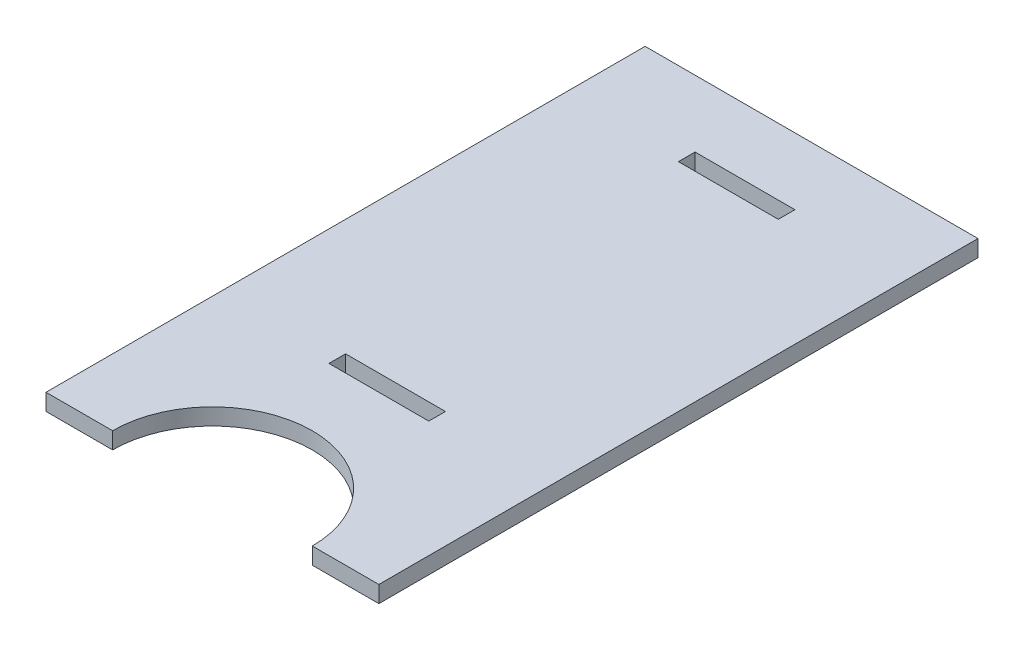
ISO-10303-21;
HEADER;
FILE_DESCRIPTION(('STEP AP214'),'2;1');
FILE_NAME('part.step','',(''),(''),'','','');
FILE_SCHEMA(('AUTOMOTIVE_DESIGN { 1 0 10303 214 1 1 1 1 }'));
ENDSEC;
DATA;
#1=APPLICATION_CONTEXT('core data for automotive mechanical design processes');
#2=APPLICATION_PROTOCOL_DEFINITION('international standard','automotive_design',2000,#1);
#3=PRODUCT_CONTEXT('',#1,'mechanical');
#4=PRODUCT('Part','Part','',(#3));
#5=PRODUCT_RELATED_PRODUCT_CATEGORY('part','',(#4));
#6=PRODUCT_DEFINITION_FORMATION('','',#4);
#7=PRODUCT_DEFINITION_CONTEXT('part definition',#1,'design');
#8=PRODUCT_DEFINITION('design','',#6,#7);
#9=PRODUCT_DEFINITION_SHAPE('','',#8);
#10=(LENGTH_UNIT() NAMED_UNIT(*) SI_UNIT(.MILLI.,.METRE.));
#11=(NAMED_UNIT(*) PLANE_ANGLE_UNIT() SI_UNIT($,.RADIAN.));
#12=(NAMED_UNIT(*) SI_UNIT($,.STERADIAN.) SOLID_ANGLE_UNIT());
#13=UNCERTAINTY_MEASURE_WITH_UNIT(LENGTH_MEASURE(1.E-05),#10,'distance_accuracy_value','');
#14=(GEOMETRIC_REPRESENTATION_CONTEXT(3) GLOBAL_UNCERTAINTY_ASSIGNED_CONTEXT((#13)) GLOBAL_UNIT_ASSIGNED_CONTEXT((#10,
#11,#12)) REPRESENTATION_CONTEXT('',''));
#15=CARTESIAN_POINT('',(0.,0.,0.));
#16=DIRECTION('',(0.,0.,1.));
#17=DIRECTION('',(1.,0.,0.));
#18=AXIS2_PLACEMENT_3D('',#15,#16,#17);
#19=CARTESIAN_POINT('',(320.516384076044,5.,0.));
#20=DIRECTION('',(-1.,0.,0.));
#21=DIRECTION('',(0.,0.,1.));
#22=AXIS2_PLACEMENT_3D('',#19,#20,#21);
#23=PLANE('',#22);
#24=DIRECTION('',(0.,0.,-1.));
#25=VECTOR('',#24,1.);
#26=CARTESIAN_POINT('',(320.516384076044,0.,0.));
#27=LINE('',#26,#25);
#28=CARTESIAN_POINT('',(320.516384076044,0.,-24.0936382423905));
#29=VERTEX_POINT('',#28);
#30=CARTESIAN_POINT('',(320.516384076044,0.,-29.0936382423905));
#31=VERTEX_POINT('',#30);
#32=EDGE_CURVE('E192',#29,#31,#27,.T.);
#33=ORIENTED_EDGE('',*,*,#32,.T.);
#34=DIRECTION('',(0.,-1.,0.));
#35=VECTOR('',#34,1.);
#36=CARTESIAN_POINT('',(320.516384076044,5.,-29.0936382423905));
#37=LINE('',#36,#35);
#38=CARTESIAN_POINT('',(320.516384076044,5.,-29.0936382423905));
#39=VERTEX_POINT('',#38);
#40=EDGE_CURVE('E11',#39,#31,#37,.T.);
#41=ORIENTED_EDGE('',*,*,#40,.F.);
#42=DIRECTION('',(0.,0.,-1.));
#43=VECTOR('',#42,1.);
#44=CARTESIAN_POINT('',(320.516384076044,5.,0.));
#45=LINE('',#44,#43);
#46=CARTESIAN_POINT('',(320.516384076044,5.,-24.0936382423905));
#47=VERTEX_POINT('',#46);
#48=EDGE_CURVE('E149',#47,#39,#45,.T.);
#49=ORIENTED_EDGE('',*,*,#48,.F.);
#50=DIRECTION('',(0.,-1.,0.));
#51=VECTOR('',#50,1.);
#52=CARTESIAN_POINT('',(320.516384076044,5.,-24.0936382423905));
#53=LINE('',#52,#51);
#54=EDGE_CURVE('E199',#47,#29,#53,.T.);
#55=ORIENTED_EDGE('',*,*,#54,.T.);
#56=EDGE_LOOP('',(#33,#41,#49,#55));
#57=FACE_BOUND('',#56,.T.);
#58=ADVANCED_FACE('F32',(#57),#23,.F.);
#59=CARTESIAN_POINT('',(0.,5.,-29.0936382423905));
#60=DIRECTION('',(0.,0.,-1.));
#61=DIRECTION('',(-1.,0.,0.));
#62=AXIS2_PLACEMENT_3D('',#59,#60,#61);
#63=PLANE('',#62);
#64=DIRECTION('',(1.,0.,0.));
#65=VECTOR('',#64,1.);
#66=CARTESIAN_POINT('',(0.,0.,-29.0936382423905));
#67=LINE('',#66,#65);
#68=CARTESIAN_POINT('',(350.516384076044,0.,-29.0936382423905));
#69=VERTEX_POINT('',#68);
#70=EDGE_CURVE('E154',#31,#69,#67,.T.);
#71=ORIENTED_EDGE('',*,*,#70,.T.);
#72=DIRECTION('',(0.,-1.,0.));
#73=VECTOR('',#72,1.);
#74=CARTESIAN_POINT('',(350.516384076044,5.,-29.0936382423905));
#75=LINE('',#74,#73);
#76=CARTESIAN_POINT('',(350.516384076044,5.,-29.0936382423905));
#77=VERTEX_POINT('',#76);
#78=EDGE_CURVE('E42',#77,#69,#75,.T.);
#79=ORIENTED_EDGE('',*,*,#78,.F.);
#80=DIRECTION('',(1.,0.,0.));
#81=VECTOR('',#80,1.);
#82=CARTESIAN_POINT('',(0.,5.,-29.0936382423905));
#83=LINE('',#82,#81);
#84=EDGE_CURVE('E143',#39,#77,#83,.T.);
#85=ORIENTED_EDGE('',*,*,#84,.F.);
#86=ORIENTED_EDGE('',*,*,#40,.T.);
#87=EDGE_LOOP('',(#71,#79,#85,#86));
#88=FACE_BOUND('',#87,.T.);
#89=ADVANCED_FACE('F153',(#88),#63,.F.);
#90=CARTESIAN_POINT('',(350.516384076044,5.,0.));
#91=DIRECTION('',(1.,0.,0.));
#92=DIRECTION('',(0.,0.,-1.));
#93=AXIS2_PLACEMENT_3D('',#90,#91,#92);
#94=PLANE('',#93);
#95=DIRECTION('',(0.,0.,1.));
#96=VECTOR('',#95,1.);
#97=CARTESIAN_POINT('',(350.516384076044,0.,0.));
#98=LINE('',#97,#96);
#99=CARTESIAN_POINT('',(350.516384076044,0.,-24.0936382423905));
#100=VERTEX_POINT('',#99);
#101=EDGE_CURVE('E98',#69,#100,#98,.T.);
#102=ORIENTED_EDGE('',*,*,#101,.T.);
#103=DIRECTION('',(0.,-1.,0.));
#104=VECTOR('',#103,1.);
#105=CARTESIAN_POINT('',(350.516384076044,5.,-24.0936382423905));
#106=LINE('',#105,#104);
#107=CARTESIAN_POINT('',(350.516384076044,5.,-24.0936382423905));
#108=VERTEX_POINT('',#107);
#109=EDGE_CURVE('E155',#108,#100,#106,.T.);
#110=ORIENTED_EDGE('',*,*,#109,.F.);
#111=DIRECTION('',(0.,0.,1.));
#112=VECTOR('',#111,1.);
#113=CARTESIAN_POINT('',(350.516384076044,5.,0.));
#114=LINE('',#113,#112);
#115=EDGE_CURVE('E147',#77,#108,#114,.T.);
#116=ORIENTED_EDGE('',*,*,#115,.F.);
#117=ORIENTED_EDGE('',*,*,#78,.T.);
#118=EDGE_LOOP('',(#102,#110,#116,#117));
#119=FACE_BOUND('',#118,.T.);
#120=ADVANCED_FACE('F157',(#119),#94,.F.);
#121=CARTESIAN_POINT('',(320.516384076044,5.,0.));
#122=DIRECTION('',(1.,0.,0.));
#123=DIRECTION('',(0.,0.,-1.));
#124=AXIS2_PLACEMENT_3D('',#121,#122,#123);
#125=PLANE('',#124);
#126=DIRECTION('',(0.,0.,1.));
#127=VECTOR('',#126,1.);
#128=CARTESIAN_POINT('',(320.516384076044,0.,0.));
#129=LINE('',#128,#127);
#130=CARTESIAN_POINT('',(320.516384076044,0.,75.9063617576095));
#131=VERTEX_POINT('',#130);
#132=CARTESIAN_POINT('',(320.516384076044,0.,80.9063617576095));
#133=VERTEX_POINT('',#132);
#134=EDGE_CURVE('E180',#131,#133,#129,.T.);
#135=ORIENTED_EDGE('',*,*,#134,.F.);
#136=DIRECTION('',(0.,-1.,0.));
#137=VECTOR('',#136,1.);
#138=CARTESIAN_POINT('',(320.516384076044,5.,75.9063617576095));
#139=LINE('',#138,#137);
#140=CARTESIAN_POINT('',(320.516384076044,5.,75.9063617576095));
#141=VERTEX_POINT('',#140);
#142=EDGE_CURVE('E201',#141,#131,#139,.T.);
#143=ORIENTED_EDGE('',*,*,#142,.F.);
#144=DIRECTION('',(0.,0.,1.));
#145=VECTOR('',#144,1.);
#146=CARTESIAN_POINT('',(320.516384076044,5.,0.));
#147=LINE('',#146,#145);
#148=CARTESIAN_POINT('',(320.516384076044,5.,80.9063617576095));
#149=VERTEX_POINT('',#148);
#150=EDGE_CURVE('E392',#141,#149,#147,.T.);
#151=ORIENTED_EDGE('',*,*,#150,.T.);
#152=DIRECTION('',(0.,-1.,0.));
#153=VECTOR('',#152,1.);
#154=CARTESIAN_POINT('',(320.516384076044,5.,80.9063617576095));
#155=LINE('',#154,#153);
#156=EDGE_CURVE('E203',#149,#133,#155,.T.);
#157=ORIENTED_EDGE('',*,*,#156,.T.);
#158=EDGE_LOOP('',(#135,#143,#151,#157));
#159=FACE_BOUND('',#158,.T.);
#160=ADVANCED_FACE('F277',(#159),#125,.T.);
#161=CARTESIAN_POINT('',(0.,5.,75.9063617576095));
#162=DIRECTION('',(0.,0.,1.));
#163=DIRECTION('',(1.,0.,0.));
#164=AXIS2_PLACEMENT_3D('',#161,#162,#163);
#165=PLANE('',#164);
#166=DIRECTION('',(-1.,0.,0.));
#167=VECTOR('',#166,1.);
#168=CARTESIAN_POINT('',(0.,0.,75.9063617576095));
#169=LINE('',#168,#167);
#170=CARTESIAN_POINT('',(350.516384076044,0.,75.9063617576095));
#171=VERTEX_POINT('',#170);
#172=EDGE_CURVE('E183',#171,#131,#169,.T.);
#173=ORIENTED_EDGE('',*,*,#172,.F.);
#174=DIRECTION('',(0.,-1.,0.));
#175=VECTOR('',#174,1.);
#176=CARTESIAN_POINT('',(350.516384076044,5.,75.9063617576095));
#177=LINE('',#176,#175);
#178=CARTESIAN_POINT('',(350.516384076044,5.,75.9063617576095));
#179=VERTEX_POINT('',#178);
#180=EDGE_CURVE('E207',#179,#171,#177,.T.);
#181=ORIENTED_EDGE('',*,*,#180,.F.);
#182=DIRECTION('',(-1.,0.,0.));
#183=VECTOR('',#182,1.);
#184=CARTESIAN_POINT('',(0.,5.,75.9063617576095));
#185=LINE('',#184,#183);
#186=EDGE_CURVE('E395',#179,#141,#185,.T.);
#187=ORIENTED_EDGE('',*,*,#186,.T.);
#188=ORIENTED_EDGE('',*,*,#142,.T.);
#189=EDGE_LOOP('',(#173,#181,#187,#188));
#190=FACE_BOUND('',#189,.T.);
#191=ADVANCED_FACE('F273',(#190),#165,.T.);
#192=CARTESIAN_POINT('',(350.516384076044,5.,0.));
#193=DIRECTION('',(-1.,0.,0.));
#194=DIRECTION('',(0.,0.,1.));
#195=AXIS2_PLACEMENT_3D('',#192,#193,#194);
#196=PLANE('',#195);
#197=DIRECTION('',(0.,0.,-1.));
#198=VECTOR('',#197,1.);
#199=CARTESIAN_POINT('',(350.516384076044,0.,0.));
#200=LINE('',#199,#198);
#201=CARTESIAN_POINT('',(350.516384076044,0.,80.9063617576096));
#202=VERTEX_POINT('',#201);
#203=EDGE_CURVE('E186',#202,#171,#200,.T.);
#204=ORIENTED_EDGE('',*,*,#203,.F.);
#205=DIRECTION('',(0.,-1.,0.));
#206=VECTOR('',#205,1.);
#207=CARTESIAN_POINT('',(350.516384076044,5.,80.9063617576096));
#208=LINE('',#207,#206);
#209=CARTESIAN_POINT('',(350.516384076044,5.,80.9063617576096));
#210=VERTEX_POINT('',#209);
#211=EDGE_CURVE('E205',#210,#202,#208,.T.);
#212=ORIENTED_EDGE('',*,*,#211,.F.);
#213=DIRECTION('',(0.,0.,-1.));
#214=VECTOR('',#213,1.);
#215=CARTESIAN_POINT('',(350.516384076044,5.,0.));
#216=LINE('',#215,#214);
#217=EDGE_CURVE('E402',#210,#179,#216,.T.);
#218=ORIENTED_EDGE('',*,*,#217,.T.);
#219=ORIENTED_EDGE('',*,*,#180,.T.);
#220=EDGE_LOOP('',(#204,#212,#218,#219));
#221=FACE_BOUND('',#220,.T.);
#222=ADVANCED_FACE('F270',(#221),#196,.T.);
#223=CARTESIAN_POINT('',(335.516384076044,5.,130.90636175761));
#224=DIRECTION('',(0.,-1.,0.));
#225=DIRECTION('',(0.,0.,-1.));
#226=AXIS2_PLACEMENT_3D('',#223,#224,#225);
#227=CYLINDRICAL_SURFACE('',#226,30.);
#228=CARTESIAN_POINT('',(335.516384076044,0.,130.90636175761));
#229=DIRECTION('',(0.,1.,0.));
#230=DIRECTION('',(0.,0.,1.));
#231=AXIS2_PLACEMENT_3D('',#228,#229,#230);
#232=CIRCLE('',#231,30.);
#233=CARTESIAN_POINT('',(365.516384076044,0.,130.90636175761));
#234=VERTEX_POINT('',#233);
#235=CARTESIAN_POINT('',(305.516384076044,0.,130.90636175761));
#236=VERTEX_POINT('',#235);
#237=EDGE_CURVE('E163',#234,#236,#232,.T.);
#238=ORIENTED_EDGE('',*,*,#237,.F.);
#239=DIRECTION('',(0.,-1.,0.));
#240=VECTOR('',#239,1.);
#241=CARTESIAN_POINT('',(365.516384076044,5.,130.90636175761));
#242=LINE('',#241,#240);
#243=CARTESIAN_POINT('',(365.516384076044,5.,130.90636175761));
#244=VERTEX_POINT('',#243);
#245=EDGE_CURVE('E36',#244,#234,#242,.T.);
#246=ORIENTED_EDGE('',*,*,#245,.F.);
#247=CARTESIAN_POINT('',(335.516384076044,5.,130.90636175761));
#248=DIRECTION('',(0.,1.,0.));
#249=DIRECTION('',(0.,0.,1.));
#250=AXIS2_PLACEMENT_3D('',#247,#248,#249);
#251=CIRCLE('',#250,30.);
#252=CARTESIAN_POINT('',(305.516384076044,5.,130.90636175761));
#253=VERTEX_POINT('',#252);
#254=EDGE_CURVE('E198',#244,#253,#251,.T.);
#255=ORIENTED_EDGE('',*,*,#254,.T.);
#256=DIRECTION('',(0.,-1.,0.));
#257=VECTOR('',#256,1.);
#258=CARTESIAN_POINT('',(305.516384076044,5.,130.90636175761));
#259=LINE('',#258,#257);
#260=EDGE_CURVE('E159',#253,#236,#259,.T.);
#261=ORIENTED_EDGE('',*,*,#260,.T.);
#262=EDGE_LOOP('',(#238,#246,#255,#261));
#263=FACE_BOUND('',#262,.T.);
#264=ADVANCED_FACE('F34',(#263),#227,.F.);
#265=CARTESIAN_POINT('',(0.,5.,130.90636175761));
#266=DIRECTION('',(0.,0.,-1.));
#267=DIRECTION('',(-1.,0.,0.));
#268=AXIS2_PLACEMENT_3D('',#265,#266,#267);
#269=PLANE('',#268);
#270=DIRECTION('',(1.,0.,0.));
#271=VECTOR('',#270,1.);
#272=CARTESIAN_POINT('',(0.,0.,130.90636175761));
#273=LINE('',#272,#271);
#274=CARTESIAN_POINT('',(385.516384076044,0.,130.90636175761));
#275=VERTEX_POINT('',#274);
#276=EDGE_CURVE('E166',#234,#275,#273,.T.);
#277=ORIENTED_EDGE('',*,*,#276,.T.);
#278=DIRECTION('',(0.,-1.,0.));
#279=VECTOR('',#278,1.);
#280=CARTESIAN_POINT('',(385.516384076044,5.,130.90636175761));
#281=LINE('',#280,#279);
#282=CARTESIAN_POINT('',(385.516384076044,5.,130.90636175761));
#283=VERTEX_POINT('',#282);
#284=EDGE_CURVE('E216',#283,#275,#281,.T.);
#285=ORIENTED_EDGE('',*,*,#284,.F.);
#286=DIRECTION('',(1.,0.,0.));
#287=VECTOR('',#286,1.);
#288=CARTESIAN_POINT('',(0.,5.,130.90636175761));
#289=LINE('',#288,#287);
#290=EDGE_CURVE('E225',#244,#283,#289,.T.);
#291=ORIENTED_EDGE('',*,*,#290,.F.);
#292=ORIENTED_EDGE('',*,*,#245,.T.);
#293=EDGE_LOOP('',(#277,#285,#291,#292));
#294=FACE_BOUND('',#293,.T.);
#295=ADVANCED_FACE('F224',(#294),#269,.F.);
#296=CARTESIAN_POINT('',(385.516384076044,5.,0.));
#297=DIRECTION('',(-1.,0.,0.));
#298=DIRECTION('',(0.,0.,1.));
#299=AXIS2_PLACEMENT_3D('',#296,#297,#298);
#300=PLANE('',#299);
#301=DIRECTION('',(0.,0.,-1.));
#302=VECTOR('',#301,1.);
#303=CARTESIAN_POINT('',(385.516384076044,0.,0.));
#304=LINE('',#303,#302);
#305=CARTESIAN_POINT('',(385.516384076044,0.,-49.0936382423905));
#306=VERTEX_POINT('',#305);
#307=EDGE_CURVE('E168',#275,#306,#304,.T.);
#308=ORIENTED_EDGE('',*,*,#307,.T.);
#309=DIRECTION('',(0.,-1.,0.));
#310=VECTOR('',#309,1.);
#311=CARTESIAN_POINT('',(385.516384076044,5.,-49.0936382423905));
#312=LINE('',#311,#310);
#313=CARTESIAN_POINT('',(385.516384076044,5.,-49.0936382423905));
#314=VERTEX_POINT('',#313);
#315=EDGE_CURVE('E215',#314,#306,#312,.T.);
#316=ORIENTED_EDGE('',*,*,#315,.F.);
#317=DIRECTION('',(0.,0.,-1.));
#318=VECTOR('',#317,1.);
#319=CARTESIAN_POINT('',(385.516384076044,5.,0.));
#320=LINE('',#319,#318);
#321=EDGE_CURVE('E414',#283,#314,#320,.T.);
#322=ORIENTED_EDGE('',*,*,#321,.F.);
#323=ORIENTED_EDGE('',*,*,#284,.T.);
#324=EDGE_LOOP('',(#308,#316,#322,#323));
#325=FACE_BOUND('',#324,.T.);
#326=ADVANCED_FACE('F249',(#325),#300,.F.);
#327=CARTESIAN_POINT('',(0.,5.,-49.0936382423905));
#328=DIRECTION('',(0.,0.,-1.));
#329=DIRECTION('',(-1.,0.,0.));
#330=AXIS2_PLACEMENT_3D('',#327,#328,#329);
#331=PLANE('',#330);
#332=DIRECTION('',(1.,0.,0.));
#333=VECTOR('',#332,1.);
#334=CARTESIAN_POINT('',(0.,0.,-49.0936382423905));
#335=LINE('',#334,#333);
#336=CARTESIAN_POINT('',(285.516384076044,0.,-49.0936382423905));
#337=VERTEX_POINT('',#336);
#338=EDGE_CURVE('E171',#337,#306,#335,.T.);
#339=ORIENTED_EDGE('',*,*,#338,.F.);
#340=DIRECTION('',(0.,-1.,0.));
#341=VECTOR('',#340,1.);
#342=CARTESIAN_POINT('',(285.516384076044,5.,-49.0936382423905));
#343=LINE('',#342,#341);
#344=CARTESIAN_POINT('',(285.516384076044,5.,-49.0936382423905));
#345=VERTEX_POINT('',#344);
#346=EDGE_CURVE('E213',#345,#337,#343,.T.);
#347=ORIENTED_EDGE('',*,*,#346,.F.);
#348=DIRECTION('',(1.,0.,0.));
#349=VECTOR('',#348,1.);
#350=CARTESIAN_POINT('',(0.,5.,-49.0936382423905));
#351=LINE('',#350,#349);
#352=EDGE_CURVE('E248',#345,#314,#351,.T.);
#353=ORIENTED_EDGE('',*,*,#352,.T.);
#354=ORIENTED_EDGE('',*,*,#315,.T.);
#355=EDGE_LOOP('',(#339,#347,#353,#354));
#356=FACE_BOUND('',#355,.T.);
#357=ADVANCED_FACE('F246',(#356),#331,.T.);
#358=CARTESIAN_POINT('',(285.516384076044,5.,0.));
#359=DIRECTION('',(-1.,0.,0.));
#360=DIRECTION('',(0.,0.,1.));
#361=AXIS2_PLACEMENT_3D('',#358,#359,#360);
#362=PLANE('',#361);
#363=DIRECTION('',(0.,0.,-1.));
#364=VECTOR('',#363,1.);
#365=CARTESIAN_POINT('',(285.516384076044,0.,0.));
#366=LINE('',#365,#364);
#367=CARTESIAN_POINT('',(285.516384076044,0.,130.90636175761));
#368=VERTEX_POINT('',#367);
#369=EDGE_CURVE('E174',#368,#337,#366,.T.);
#370=ORIENTED_EDGE('',*,*,#369,.F.);
#371=DIRECTION('',(0.,-1.,0.));
#372=VECTOR('',#371,1.);
#373=CARTESIAN_POINT('',(285.516384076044,5.,130.90636175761));
#374=LINE('',#373,#372);
#375=CARTESIAN_POINT('',(285.516384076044,5.,130.90636175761));
#376=VERTEX_POINT('',#375);
#377=EDGE_CURVE('E211',#376,#368,#374,.T.);
#378=ORIENTED_EDGE('',*,*,#377,.F.);
#379=DIRECTION('',(0.,0.,-1.));
#380=VECTOR('',#379,1.);
#381=CARTESIAN_POINT('',(285.516384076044,5.,0.));
#382=LINE('',#381,#380);
#383=EDGE_CURVE('E242',#376,#345,#382,.T.);
#384=ORIENTED_EDGE('',*,*,#383,.T.);
#385=ORIENTED_EDGE('',*,*,#346,.T.);
#386=EDGE_LOOP('',(#370,#378,#384,#385));
#387=FACE_BOUND('',#386,.T.);
#388=ADVANCED_FACE('F239',(#387),#362,.T.);
#389=CARTESIAN_POINT('',(0.,5.,80.9063617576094));
#390=DIRECTION('',(0.,0.,-1.));
#391=DIRECTION('',(-1.,0.,0.));
#392=AXIS2_PLACEMENT_3D('',#389,#390,#391);
#393=PLANE('',#392);
#394=DIRECTION('',(1.,0.,0.));
#395=VECTOR('',#394,1.);
#396=CARTESIAN_POINT('',(0.,0.,80.9063617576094));
#397=LINE('',#396,#395);
#398=EDGE_CURVE('E189',#133,#202,#397,.T.);
#399=ORIENTED_EDGE('',*,*,#398,.F.);
#400=ORIENTED_EDGE('',*,*,#156,.F.);
#401=DIRECTION('',(1.,0.,0.));
#402=VECTOR('',#401,1.);
#403=CARTESIAN_POINT('',(0.,5.,80.9063617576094));
#404=LINE('',#403,#402);
#405=EDGE_CURVE('E398',#149,#210,#404,.T.);
#406=ORIENTED_EDGE('',*,*,#405,.T.);
#407=ORIENTED_EDGE('',*,*,#211,.T.);
#408=EDGE_LOOP('',(#399,#400,#406,#407));
#409=FACE_BOUND('',#408,.T.);
#410=ADVANCED_FACE('F266',(#409),#393,.T.);
#411=CARTESIAN_POINT('',(0.,5.,130.90636175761));
#412=DIRECTION('',(0.,0.,1.));
#413=DIRECTION('',(1.,0.,0.));
#414=AXIS2_PLACEMENT_3D('',#411,#412,#413);
#415=PLANE('',#414);
#416=DIRECTION('',(-1.,0.,0.));
#417=VECTOR('',#416,1.);
#418=CARTESIAN_POINT('',(0.,0.,130.90636175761));
#419=LINE('',#418,#417);
#420=EDGE_CURVE('E177',#236,#368,#419,.T.);
#421=ORIENTED_EDGE('',*,*,#420,.F.);
#422=ORIENTED_EDGE('',*,*,#260,.F.);
#423=DIRECTION('',(-1.,0.,0.));
#424=VECTOR('',#423,1.);
#425=CARTESIAN_POINT('',(0.,5.,130.90636175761));
#426=LINE('',#425,#424);
#427=EDGE_CURVE('E235',#253,#376,#426,.T.);
#428=ORIENTED_EDGE('',*,*,#427,.T.);
#429=ORIENTED_EDGE('',*,*,#377,.T.);
#430=EDGE_LOOP('',(#421,#422,#428,#429));
#431=FACE_BOUND('',#430,.T.);
#432=ADVANCED_FACE('F234',(#431),#415,.T.);
#433=CARTESIAN_POINT('',(0.,5.,-24.0936382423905));
#434=DIRECTION('',(0.,0.,1.));
#435=DIRECTION('',(1.,0.,0.));
#436=AXIS2_PLACEMENT_3D('',#433,#434,#435);
#437=PLANE('',#436);
#438=DIRECTION('',(-1.,0.,0.));
#439=VECTOR('',#438,1.);
#440=CARTESIAN_POINT('',(0.,0.,-24.0936382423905));
#441=LINE('',#440,#439);
#442=EDGE_CURVE('E104',#100,#29,#441,.T.);
#443=ORIENTED_EDGE('',*,*,#442,.T.);
#444=ORIENTED_EDGE('',*,*,#54,.F.);
#445=DIRECTION('',(-1.,0.,0.));
#446=VECTOR('',#445,1.);
#447=CARTESIAN_POINT('',(0.,5.,-24.0936382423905));
#448=LINE('',#447,#446);
#449=EDGE_CURVE('E51',#108,#47,#448,.T.);
#450=ORIENTED_EDGE('',*,*,#449,.F.);
#451=ORIENTED_EDGE('',*,*,#109,.T.);
#452=EDGE_LOOP('',(#443,#444,#450,#451));
#453=FACE_BOUND('',#452,.T.);
#454=ADVANCED_FACE('F284',(#453),#437,.F.);
#455=CARTESIAN_POINT('',(0.,5.,0.));
#456=DIRECTION('',(0.,1.,0.));
#457=DIRECTION('',(0.,0.,1.));
#458=AXIS2_PLACEMENT_3D('',#455,#456,#457);
#459=PLANE('',#458);
#460=ORIENTED_EDGE('',*,*,#254,.F.);
#461=ORIENTED_EDGE('',*,*,#290,.T.);
#462=ORIENTED_EDGE('',*,*,#321,.T.);
#463=ORIENTED_EDGE('',*,*,#352,.F.);
#464=ORIENTED_EDGE('',*,*,#383,.F.);
#465=ORIENTED_EDGE('',*,*,#427,.F.);
#466=EDGE_LOOP('',(#460,#461,#462,#463,#464,#465));
#467=FACE_BOUND('',#466,.T.);
#468=ORIENTED_EDGE('',*,*,#150,.F.);
#469=ORIENTED_EDGE('',*,*,#186,.F.);
#470=ORIENTED_EDGE('',*,*,#217,.F.);
#471=ORIENTED_EDGE('',*,*,#405,.F.);
#472=EDGE_LOOP('',(#468,#469,#470,#471));
#473=FACE_BOUND('',#472,.T.);
#474=ORIENTED_EDGE('',*,*,#48,.T.);
#475=ORIENTED_EDGE('',*,*,#84,.T.);
#476=ORIENTED_EDGE('',*,*,#115,.T.);
#477=ORIENTED_EDGE('',*,*,#449,.T.);
#478=EDGE_LOOP('',(#474,#475,#476,#477));
#479=FACE_BOUND('',#478,.T.);
#480=ADVANCED_FACE('F145',(#467,#473,#479),#459,.T.);
#481=CARTESIAN_POINT('',(0.,0.,0.));
#482=DIRECTION('',(0.,1.,0.));
#483=DIRECTION('',(0.,0.,1.));
#484=AXIS2_PLACEMENT_3D('',#481,#482,#483);
#485=PLANE('',#484);
#486=ORIENTED_EDGE('',*,*,#237,.T.);
#487=ORIENTED_EDGE('',*,*,#420,.T.);
#488=ORIENTED_EDGE('',*,*,#369,.T.);
#489=ORIENTED_EDGE('',*,*,#338,.T.);
#490=ORIENTED_EDGE('',*,*,#307,.F.);
#491=ORIENTED_EDGE('',*,*,#276,.F.);
#492=EDGE_LOOP('',(#486,#487,#488,#489,#490,#491));
#493=FACE_BOUND('',#492,.T.);
#494=ORIENTED_EDGE('',*,*,#134,.T.);
#495=ORIENTED_EDGE('',*,*,#398,.T.);
#496=ORIENTED_EDGE('',*,*,#203,.T.);
#497=ORIENTED_EDGE('',*,*,#172,.T.);
#498=EDGE_LOOP('',(#494,#495,#496,#497));
#499=FACE_BOUND('',#498,.T.);
#500=ORIENTED_EDGE('',*,*,#32,.F.);
#501=ORIENTED_EDGE('',*,*,#442,.F.);
#502=ORIENTED_EDGE('',*,*,#101,.F.);
#503=ORIENTED_EDGE('',*,*,#70,.F.);
#504=EDGE_LOOP('',(#500,#501,#502,#503));
#505=FACE_BOUND('',#504,.T.);
#506=ADVANCED_FACE('F228',(#493,#499,#505),#485,.F.);
#507=CLOSED_SHELL('',(#58,#89,#120,#160,#191,#222,#264,#295,#326,#357,#388,#410,#432,#454,#480,#506));
#508=MANIFOLD_SOLID_BREP('B2',#507);
#509=ADVANCED_BREP_SHAPE_REPRESENTATION('',(#18,#508),#14);
#510=SHAPE_DEFINITION_REPRESENTATION(#9,#509);
ENDSEC;
END-ISO-10303-21;
